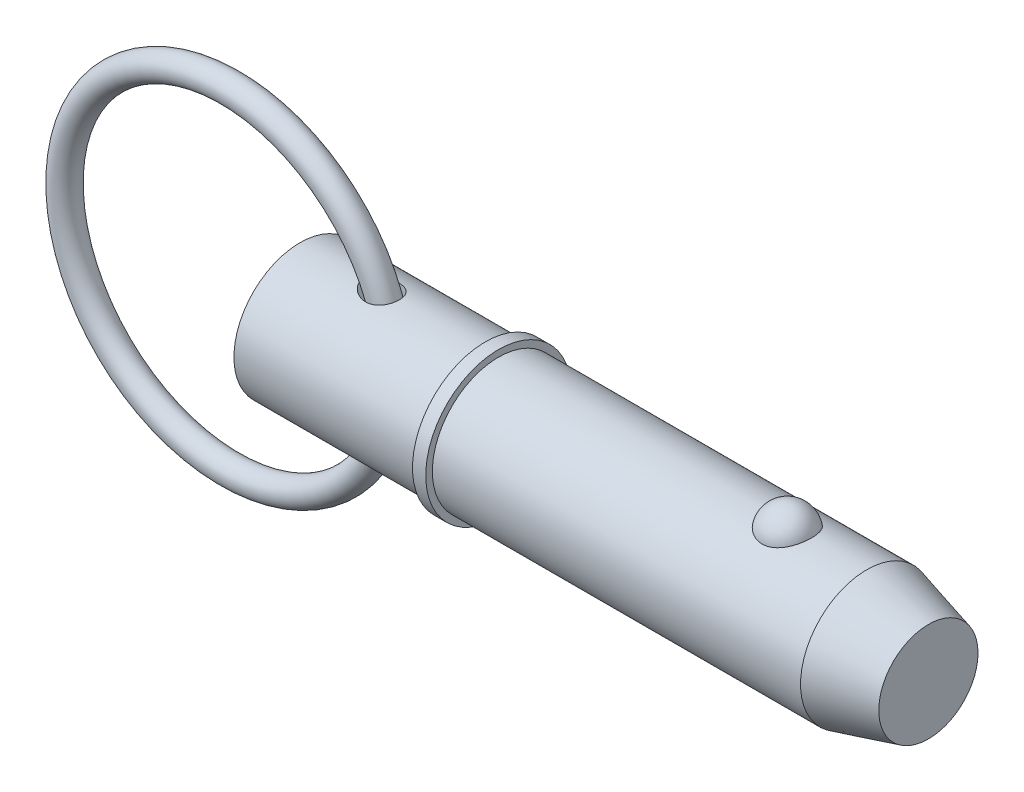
ISO-10303-21;
HEADER;
FILE_DESCRIPTION(('STEP AP214'),'2;1');
FILE_NAME('part.step','',(''),(''),'','','');
FILE_SCHEMA(('AUTOMOTIVE_DESIGN { 1 0 10303 214 1 1 1 1 }'));
ENDSEC;
DATA;
#1=APPLICATION_CONTEXT('core data for automotive mechanical design processes');
#2=APPLICATION_PROTOCOL_DEFINITION('international standard','automotive_design',2000,#1);
#3=PRODUCT_CONTEXT('',#1,'mechanical');
#4=PRODUCT('Part','Part','',(#3));
#5=PRODUCT_RELATED_PRODUCT_CATEGORY('part','',(#4));
#6=PRODUCT_DEFINITION_FORMATION('','',#4);
#7=PRODUCT_DEFINITION_CONTEXT('part definition',#1,'design');
#8=PRODUCT_DEFINITION('design','',#6,#7);
#9=PRODUCT_DEFINITION_SHAPE('','',#8);
#10=(LENGTH_UNIT() NAMED_UNIT(*) SI_UNIT(.MILLI.,.METRE.));
#11=(NAMED_UNIT(*) PLANE_ANGLE_UNIT() SI_UNIT($,.RADIAN.));
#12=(NAMED_UNIT(*) SI_UNIT($,.STERADIAN.) SOLID_ANGLE_UNIT());
#13=UNCERTAINTY_MEASURE_WITH_UNIT(LENGTH_MEASURE(1.E-05),#10,'distance_accuracy_value','');
#14=(GEOMETRIC_REPRESENTATION_CONTEXT(3) GLOBAL_UNCERTAINTY_ASSIGNED_CONTEXT((#13)) GLOBAL_UNIT_ASSIGNED_CONTEXT((#10,
#11,#12)) REPRESENTATION_CONTEXT('',''));
#15=CARTESIAN_POINT('',(0.,0.,0.));
#16=DIRECTION('',(0.,0.,1.));
#17=DIRECTION('',(1.,0.,0.));
#18=AXIS2_PLACEMENT_3D('',#15,#16,#17);
#19=CARTESIAN_POINT('',(-13.4840686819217,0.,0.));
#20=DIRECTION('',(0.,0.,1.));
#21=DIRECTION('',(1.,0.,0.));
#22=AXIS2_PLACEMENT_3D('',#19,#20,#21);
#23=TOROIDAL_SURFACE('',#22,31.75,2.54);
#24=CARTESIAN_POINT('',(20.8059313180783,0.,0.));
#25=VERTEX_POINT('',#24);
#26=VERTEX_LOOP('',#25);
#27=FACE_BOUND('',#26,.T.);
#28=ADVANCED_FACE('P0_F12',(#27),#23,.T.);
#29=CLOSED_SHELL('',(#28));
#30=MANIFOLD_SOLID_BREP('P0_B1',#29);
#31=CARTESIAN_POINT('',(0.,0.,0.));
#32=DIRECTION('',(1.,0.,0.));
#33=DIRECTION('',(0.,0.,-1.));
#34=AXIS2_PLACEMENT_3D('',#31,#32,#33);
#35=CYLINDRICAL_SURFACE('',#34,12.7);
#36=CARTESIAN_POINT('',(13.092900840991,12.5230976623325,-2.11234992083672));
#37=CARTESIAN_POINT('',(13.2535855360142,12.4976398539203,-2.26328363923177));
#38=CARTESIAN_POINT('',(13.4280602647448,12.4718592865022,-2.3995578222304));
#39=CARTESIAN_POINT('',(13.7976341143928,12.4229301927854,-2.64122157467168));
#40=CARTESIAN_POINT('',(13.9927568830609,12.3997847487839,-2.74657519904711));
#41=CARTESIAN_POINT('',(14.397672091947,12.3590534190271,-2.92439761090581));
#42=CARTESIAN_POINT('',(14.6074445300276,12.3414601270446,-2.99691026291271));
#43=CARTESIAN_POINT('',(15.0366557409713,12.3142893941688,-3.10669649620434));
#44=CARTESIAN_POINT('',(15.2560902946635,12.3047084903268,-3.14398530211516));
#45=CARTESIAN_POINT('',(15.5877843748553,12.2976819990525,-3.17128282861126));
#46=CARTESIAN_POINT('',(15.6989364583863,12.2965677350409,-3.17559470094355));
#47=CARTESIAN_POINT('',(15.9211629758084,12.2969101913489,-3.17427486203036));
#48=CARTESIAN_POINT('',(16.0322374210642,12.2983656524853,-3.16864802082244));
#49=CARTESIAN_POINT('',(16.2532861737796,12.3038832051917,-3.14715368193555));
#50=CARTESIAN_POINT('',(16.363260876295,12.3079443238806,-3.13129000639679));
#51=CARTESIAN_POINT('',(16.5810669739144,12.3185954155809,-3.08912320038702));
#52=CARTESIAN_POINT('',(16.6888986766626,12.3251850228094,-3.06282157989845));
#53=CARTESIAN_POINT('',(16.8894247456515,12.3398294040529,-3.00323791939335));
#54=CARTESIAN_POINT('',(16.9824664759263,12.3476389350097,-2.97106098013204));
#55=CARTESIAN_POINT('',(17.1651267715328,12.3648759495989,-2.89848824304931));
#56=CARTESIAN_POINT('',(17.2547457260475,12.3743032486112,-2.85809338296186));
#57=CARTESIAN_POINT('',(17.4297224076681,12.3944822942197,-2.76927391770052));
#58=CARTESIAN_POINT('',(17.5150817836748,12.40523352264,-2.72085245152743));
#59=CARTESIAN_POINT('',(17.6807665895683,12.4277046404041,-2.61629867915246));
#60=CARTESIAN_POINT('',(17.7610923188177,12.4394244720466,-2.56016683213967));
#61=CARTESIAN_POINT('',(17.9797287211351,12.4733252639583,-2.39133767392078));
#62=CARTESIAN_POINT('',(18.1114611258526,12.4961902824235,-2.27005507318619));
#63=CARTESIAN_POINT('',(18.3518677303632,12.5412050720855,-2.00648954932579));
#64=CARTESIAN_POINT('',(18.4605454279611,12.5633549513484,-1.86420981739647));
#65=CARTESIAN_POINT('',(18.6498843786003,12.6039384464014,-1.56614816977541));
#66=CARTESIAN_POINT('',(18.7311185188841,12.622444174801,-1.41073996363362));
#67=CARTESIAN_POINT('',(18.8669149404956,12.6543302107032,-1.08819514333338));
#68=CARTESIAN_POINT('',(18.921477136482,12.6677105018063,-0.921058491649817));
#69=CARTESIAN_POINT('',(19.0028875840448,12.6879542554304,-0.579029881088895));
#70=CARTESIAN_POINT('',(19.0296164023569,12.6947896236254,-0.404107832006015));
#71=CARTESIAN_POINT('',(19.0543673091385,12.7011128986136,-0.0521104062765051));
#72=CARTESIAN_POINT('',(19.0523885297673,12.7006005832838,0.124965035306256));
#73=CARTESIAN_POINT('',(19.019700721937,12.692266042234,0.476969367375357));
#74=CARTESIAN_POINT('',(18.9888798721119,12.6844153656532,0.651887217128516));
#75=CARTESIAN_POINT('',(18.8990221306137,12.6622099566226,0.99389064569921));
#76=CARTESIAN_POINT('',(18.839985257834,12.6478552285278,1.16097622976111));
#77=CARTESIAN_POINT('',(18.6951419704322,12.6142309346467,1.48231767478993));
#78=CARTESIAN_POINT('',(18.6093706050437,12.5949678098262,1.63659000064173));
#79=CARTESIAN_POINT('',(18.4131352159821,12.5536490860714,1.92810749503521));
#80=CARTESIAN_POINT('',(18.3026732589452,12.5315937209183,2.06535408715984));
#81=CARTESIAN_POINT('',(18.060669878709,12.4872833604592,2.31822774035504));
#82=CARTESIAN_POINT('',(17.9292520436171,12.4650302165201,2.43397343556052));
#83=CARTESIAN_POINT('',(17.6485957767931,12.4226514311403,2.64178289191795));
#84=CARTESIAN_POINT('',(17.4993587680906,12.4025256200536,2.73384854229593));
#85=CARTESIAN_POINT('',(17.1869531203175,12.3664726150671,2.8925825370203));
#86=CARTESIAN_POINT('',(17.0237450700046,12.3505578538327,2.95917592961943));
#87=CARTESIAN_POINT('',(16.6884731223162,12.3245177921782,3.06582547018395));
#88=CARTESIAN_POINT('',(16.516407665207,12.3143935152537,3.10587692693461));
#89=CARTESIAN_POINT('',(16.1604213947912,12.3003788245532,3.16093927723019));
#90=CARTESIAN_POINT('',(15.9763106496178,12.2967791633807,3.17478342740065));
#91=CARTESIAN_POINT('',(15.6080973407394,12.2966663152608,3.17521180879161));
#92=CARTESIAN_POINT('',(15.4239948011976,12.3001555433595,3.16178674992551));
#93=CARTESIAN_POINT('',(15.0417156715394,12.3141744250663,3.10676725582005));
#94=CARTESIAN_POINT('',(14.8439465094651,12.3253658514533,3.06251977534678));
#95=CARTESIAN_POINT('',(14.4574652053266,12.3538942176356,2.94531863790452));
#96=CARTESIAN_POINT('',(14.2687614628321,12.3712367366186,2.87233891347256));
#97=CARTESIAN_POINT('',(13.8856104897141,12.4121323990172,2.69045747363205));
#98=CARTESIAN_POINT('',(13.6926012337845,12.4361434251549,2.57861276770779));
#99=CARTESIAN_POINT('',(13.328588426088,12.4862632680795,2.32379935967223));
#100=CARTESIAN_POINT('',(13.1575718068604,12.5123708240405,2.18084927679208));
#101=CARTESIAN_POINT('',(12.8776146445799,12.5579467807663,1.89840233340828));
#102=CARTESIAN_POINT('',(12.7631663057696,12.5776642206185,1.76440341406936));
#103=CARTESIAN_POINT('',(12.5574911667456,12.6143643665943,1.47931295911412));
#104=CARTESIAN_POINT('',(12.4662309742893,12.6313509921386,1.32824646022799));
#105=CARTESIAN_POINT('',(12.3240650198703,12.6583901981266,1.03598403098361));
#106=CARTESIAN_POINT('',(12.2691183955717,12.6691064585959,0.896822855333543));
#107=CARTESIAN_POINT('',(12.1828741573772,12.6860954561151,0.611068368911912));
#108=CARTESIAN_POINT('',(12.1515620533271,12.6923709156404,0.464479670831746));
#109=CARTESIAN_POINT('',(12.1147168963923,12.6997676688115,0.167420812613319));
#110=CARTESIAN_POINT('',(12.1092708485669,12.7008715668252,0.0169392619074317));
#111=CARTESIAN_POINT('',(12.1248234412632,12.6977391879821,-0.282592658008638));
#112=CARTESIAN_POINT('',(12.1458245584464,12.6935024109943,-0.431642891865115));
#113=CARTESIAN_POINT('',(12.210908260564,12.6805581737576,-0.716008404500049));
#114=CARTESIAN_POINT('',(12.2537133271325,12.6720986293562,-0.851633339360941));
#115=CARTESIAN_POINT('',(12.3591295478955,12.6516826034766,-1.11460776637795));
#116=CARTESIAN_POINT('',(12.4217455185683,12.6397252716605,-1.24195523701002));
#117=CARTESIAN_POINT('',(12.5735635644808,12.61152213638,-1.50300095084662));
#118=CARTESIAN_POINT('',(12.6652159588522,12.5949150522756,-1.63522875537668));
#119=CARTESIAN_POINT('',(12.8664347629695,12.5599626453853,-1.88501670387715));
#120=CARTESIAN_POINT('',(12.9760196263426,12.541615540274,-2.0025615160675));
#121=CARTESIAN_POINT('',(13.092900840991,12.5230976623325,-2.11234992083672));
#122=B_SPLINE_CURVE_WITH_KNOTS('',3,(#36,#37,#38,#39,#40,#41,#42,#43,#44,#45,#46,#47,#48,#49,
#50,#51,#52,#53,#54,#55,#56,#57,#58,#59,#60,#61,#62,#63,#64,#65,#66,#67,#68,#69,#70,#71,#72,#73,
#74,#75,#76,#77,#78,#79,#80,#81,#82,#83,#84,#85,#86,#87,#88,#89,#90,#91,#92,#93,#94,#95,#96,#97,
#98,#99,#100,#101,#102,#103,#104,#105,#106,#107,#108,#109,#110,#111,#112,#113,#114,#115,#116,
#117,#118,#119,#120,#121),.UNSPECIFIED.,.T.,.F.,(4,2,2,2,2,2,2,2,2,2,2,2,2,2,2,2,2,2,2,2,2,2,2,
2,2,2,2,2,2,2,2,2,2,2,2,2,2,2,2,2,2,2,4),(0.,0.665132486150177,1.33103515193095,
1.99604575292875,2.66076878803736,2.99410229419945,3.32727250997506,3.66031840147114,
3.99331613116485,4.28918991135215,4.58502994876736,4.88075456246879,5.17646157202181,
5.71510826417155,6.2536731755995,6.78017774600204,7.30668400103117,7.83544030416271,
8.36421259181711,8.89504347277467,9.42587399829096,9.95601150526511,10.4861046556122,
11.0131799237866,11.5402131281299,12.0687854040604,12.5974510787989,13.1491450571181,
13.7010270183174,14.3074556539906,14.914435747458,15.5844380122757,16.2540403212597,
16.7839879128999,17.3131679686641,17.7612578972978,18.2090728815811,18.658393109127,
19.1077554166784,19.5333866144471,19.959121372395,20.4424347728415,20.9262486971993),.UNSPECIFIED.);
#123=CARTESIAN_POINT('',(13.092900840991,12.5230976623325,-2.11234992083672));
#124=VERTEX_POINT('',#123);
#125=EDGE_CURVE('P1_E42',#124,#124,#122,.T.);
#126=ORIENTED_EDGE('',*,*,#125,.T.);
#127=EDGE_LOOP('',(#126));
#128=FACE_BOUND('',#127,.T.);
#129=CARTESIAN_POINT('',(0.,0.,0.));
#130=DIRECTION('',(1.,0.,0.));
#131=DIRECTION('',(0.,0.,-1.));
#132=AXIS2_PLACEMENT_3D('',#129,#130,#131);
#133=CIRCLE('',#132,12.7);
#134=CARTESIAN_POINT('',(0.,0.,-12.7));
#135=VERTEX_POINT('',#134);
#136=EDGE_CURVE('P1_E9',#135,#135,#133,.T.);
#137=ORIENTED_EDGE('',*,*,#136,.T.);
#138=EDGE_LOOP('',(#137));
#139=FACE_BOUND('',#138,.T.);
#140=CARTESIAN_POINT('',(35.56,0.,0.));
#141=DIRECTION('',(1.,0.,0.));
#142=DIRECTION('',(0.,0.,-1.));
#143=AXIS2_PLACEMENT_3D('',#140,#141,#142);
#144=CIRCLE('',#143,12.7);
#145=CARTESIAN_POINT('',(35.56,0.,-12.7));
#146=VERTEX_POINT('',#145);
#147=EDGE_CURVE('P1_E25',#146,#146,#144,.T.);
#148=ORIENTED_EDGE('',*,*,#147,.F.);
#149=EDGE_LOOP('',(#148));
#150=FACE_BOUND('',#149,.T.);
#151=CARTESIAN_POINT('',(13.092900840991,-12.5230976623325,-2.11234992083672));
#152=CARTESIAN_POINT('',(12.9659872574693,-12.5432050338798,-1.99314161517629));
#153=CARTESIAN_POINT('',(12.847667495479,-12.5631124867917,-1.86478966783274));
#154=CARTESIAN_POINT('',(12.6324721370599,-12.6007427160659,-1.59069749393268));
#155=CARTESIAN_POINT('',(12.5355833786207,-12.6184668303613,-1.444968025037));
#156=CARTESIAN_POINT('',(12.409907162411,-12.642034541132,-1.21450950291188));
#157=CARTESIAN_POINT('',(12.3711427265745,-12.6494175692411,-1.13527163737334));
#158=CARTESIAN_POINT('',(12.3010994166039,-12.6628962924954,-0.973464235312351));
#159=CARTESIAN_POINT('',(12.2698164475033,-12.6689926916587,-0.890896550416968));
#160=CARTESIAN_POINT('',(12.2153933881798,-12.6796767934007,-0.723090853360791));
#161=CARTESIAN_POINT('',(12.192246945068,-12.6842656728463,-0.637854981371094));
#162=CARTESIAN_POINT('',(12.154603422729,-12.6917620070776,-0.465421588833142));
#163=CARTESIAN_POINT('',(12.1401047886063,-12.69466976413,-0.378224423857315));
#164=CARTESIAN_POINT('',(12.1214471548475,-12.6984180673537,-0.214417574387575));
#165=CARTESIAN_POINT('',(12.1161713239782,-12.699481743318,-0.137938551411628));
#166=CARTESIAN_POINT('',(12.1124989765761,-12.7002217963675,0.0152189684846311));
#167=CARTESIAN_POINT('',(12.1141046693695,-12.6998977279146,0.0918975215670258));
#168=CARTESIAN_POINT('',(12.1241695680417,-12.6978712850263,0.24474645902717));
#169=CARTESIAN_POINT('',(12.132625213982,-12.6961696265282,0.320917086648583));
#170=CARTESIAN_POINT('',(12.1562110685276,-12.6914452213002,0.472185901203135));
#171=CARTESIAN_POINT('',(12.1713438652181,-12.6884219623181,0.547283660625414));
#172=CARTESIAN_POINT('',(12.223731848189,-12.6780227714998,0.759415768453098));
#173=CARTESIAN_POINT('',(12.268839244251,-12.6691353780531,0.894507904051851));
#174=CARTESIAN_POINT('',(12.3786059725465,-12.6479567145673,1.1560647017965));
#175=CARTESIAN_POINT('',(12.4432700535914,-12.6356646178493,1.28252725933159));
#176=CARTESIAN_POINT('',(12.5971341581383,-12.607236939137,1.5381272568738));
#177=CARTESIAN_POINT('',(12.6882234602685,-12.5908303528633,1.66609325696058));
#178=CARTESIAN_POINT('',(12.887209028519,-12.5564642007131,1.90792082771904));
#179=CARTESIAN_POINT('',(12.995115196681,-12.5385037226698,2.02177401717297));
#180=CARTESIAN_POINT('',(13.2471335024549,-12.4987806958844,2.25547266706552));
#181=CARTESIAN_POINT('',(13.3941979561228,-12.4769622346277,2.3721269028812));
#182=CARTESIAN_POINT('',(13.7036983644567,-12.4349587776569,2.58329351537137));
#183=CARTESIAN_POINT('',(13.8661464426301,-12.4147750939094,2.67778822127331));
#184=CARTESIAN_POINT('',(14.2306024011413,-12.3748157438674,2.85722657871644));
#185=CARTESIAN_POINT('',(14.4347220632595,-12.3556533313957,2.93804226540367));
#186=CARTESIAN_POINT('',(14.8540416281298,-12.3245430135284,3.06594877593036));
#187=CARTESIAN_POINT('',(15.0692453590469,-12.3125976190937,3.11302786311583));
#188=CARTESIAN_POINT('',(15.3981213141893,-12.3014943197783,3.15648626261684));
#189=CARTESIAN_POINT('',(15.5100235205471,-12.298940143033,3.16639841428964));
#190=CARTESIAN_POINT('',(15.7342812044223,-12.2963942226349,3.17627668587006));
#191=CARTESIAN_POINT('',(15.8466364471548,-12.2964012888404,3.1762474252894));
#192=CARTESIAN_POINT('',(16.0707903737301,-12.2990694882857,3.16589868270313));
#193=CARTESIAN_POINT('',(16.1825892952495,-12.3017293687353,3.1555840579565));
#194=CARTESIAN_POINT('',(16.4046123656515,-12.3096862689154,3.12440163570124));
#195=CARTESIAN_POINT('',(16.514836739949,-12.314982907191,3.10353536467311));
#196=CARTESIAN_POINT('',(16.7211934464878,-12.3273933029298,3.05384263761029));
#197=CARTESIAN_POINT('',(16.8175961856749,-12.3342598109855,3.0260738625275));
#198=CARTESIAN_POINT('',(17.0073515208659,-12.3498131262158,2.96195947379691));
#199=CARTESIAN_POINT('',(17.100704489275,-12.3584997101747,2.92561491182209));
#200=CARTESIAN_POINT('',(17.2834584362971,-12.3774243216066,2.84448580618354));
#201=CARTESIAN_POINT('',(17.3728610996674,-12.3876616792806,2.79970490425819));
#202=CARTESIAN_POINT('',(17.5469061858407,-12.409352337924,2.701939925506));
#203=CARTESIAN_POINT('',(17.6315489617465,-12.4208055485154,2.64895645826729));
#204=CARTESIAN_POINT('',(17.7872886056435,-12.4433734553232,2.54070972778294));
#205=CARTESIAN_POINT('',(17.8589017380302,-12.4544123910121,2.48617167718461));
#206=CARTESIAN_POINT('',(17.9970802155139,-12.4768404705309,2.37105291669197));
#207=CARTESIAN_POINT('',(18.063643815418,-12.4882297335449,2.31047013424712));
#208=CARTESIAN_POINT('',(18.1911677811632,-12.5110137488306,2.18372894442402));
#209=CARTESIAN_POINT('',(18.2521311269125,-12.5224084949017,2.11757353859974));
#210=CARTESIAN_POINT('',(18.3680676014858,-12.5448751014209,1.98014449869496));
#211=CARTESIAN_POINT('',(18.4230385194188,-12.5559468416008,1.90886899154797));
#212=CARTESIAN_POINT('',(18.5752306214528,-12.5875288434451,1.69257698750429));
#213=CARTESIAN_POINT('',(18.6637018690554,-12.6071482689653,1.54111740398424));
#214=CARTESIAN_POINT('',(18.8143485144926,-12.6417556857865,1.225260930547));
#215=CARTESIAN_POINT('',(18.876524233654,-12.6567437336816,1.06086419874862));
#216=CARTESIAN_POINT('',(18.9733884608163,-12.6805238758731,0.723195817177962));
#217=CARTESIAN_POINT('',(19.0079967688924,-12.6892978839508,0.549899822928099));
#218=CARTESIAN_POINT('',(19.0486500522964,-12.6996362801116,0.199781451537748));
#219=CARTESIAN_POINT('',(19.054694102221,-12.7012004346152,0.0229589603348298));
#220=CARTESIAN_POINT('',(19.0380549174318,-12.6969431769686,-0.330044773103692));
#221=CARTESIAN_POINT('',(19.0152419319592,-12.6910884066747,-0.506219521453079));
#222=CARTESIAN_POINT('',(18.9411599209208,-12.672565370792,-0.852112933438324));
#223=CARTESIAN_POINT('',(18.8898907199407,-12.659897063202,-1.0218315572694));
#224=CARTESIAN_POINT('',(18.7600888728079,-12.6291327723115,-1.34987035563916));
#225=CARTESIAN_POINT('',(18.6815715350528,-12.6110398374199,-1.50819687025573));
#226=CARTESIAN_POINT('',(18.4991526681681,-12.5714188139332,-1.808997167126));
#227=CARTESIAN_POINT('',(18.3952529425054,-12.5498909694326,-1.95147207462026));
#228=CARTESIAN_POINT('',(18.1653806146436,-12.5059234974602,-2.21580059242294));
#229=CARTESIAN_POINT('',(18.0395297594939,-12.4834893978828,-2.33776101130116));
#230=CARTESIAN_POINT('',(17.7688701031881,-12.4400863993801,-2.55870399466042));
#231=CARTESIAN_POINT('',(17.6240631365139,-12.4191173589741,-2.65768878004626));
#232=CARTESIAN_POINT('',(17.3196803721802,-12.380896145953,-2.8304192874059));
#233=CARTESIAN_POINT('',(17.1601036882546,-12.3636441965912,-2.90416349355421));
#234=CARTESIAN_POINT('',(16.8308162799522,-12.3345597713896,-3.02531546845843));
#235=CARTESIAN_POINT('',(16.6611041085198,-12.322728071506,-3.07271946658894));
#236=CARTESIAN_POINT('',(16.3099674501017,-12.3051318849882,-3.14246490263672));
#237=CARTESIAN_POINT('',(16.1283412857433,-12.2996014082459,-3.16384159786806));
#238=CARTESIAN_POINT('',(15.7639014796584,-12.2955807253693,-3.17942379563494));
#239=CARTESIAN_POINT('',(15.5810875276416,-12.2970924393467,-3.17362188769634));
#240=CARTESIAN_POINT('',(15.20154276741,-12.307074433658,-3.13470416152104));
#241=CARTESIAN_POINT('',(15.0050835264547,-12.316173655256,-3.09911848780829));
#242=CARTESIAN_POINT('',(14.6197996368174,-12.3407987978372,-2.99954607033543));
#243=CARTESIAN_POINT('',(14.4309834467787,-12.3563316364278,-2.93552875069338));
#244=CARTESIAN_POINT('',(14.0353751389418,-12.3949378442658,-2.76840280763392));
#245=CARTESIAN_POINT('',(13.8306109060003,-12.4188242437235,-2.66064798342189));
#246=CARTESIAN_POINT('',(13.4432099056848,-12.4696241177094,-2.4113475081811));
#247=CARTESIAN_POINT('',(13.2605568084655,-12.4965353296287,-2.26982702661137));
#248=CARTESIAN_POINT('',(13.092900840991,-12.5230976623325,-2.11234992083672));
#249=B_SPLINE_CURVE_WITH_KNOTS('',3,(#151,#152,#153,#154,#155,#156,#157,#158,#159,#160,#161,
#162,#163,#164,#165,#166,#167,#168,#169,#170,#171,#172,#173,#174,#175,#176,#177,#178,#179,#180,
#181,#182,#183,#184,#185,#186,#187,#188,#189,#190,#191,#192,#193,#194,#195,#196,#197,#198,#199,
#200,#201,#202,#203,#204,#205,#206,#207,#208,#209,#210,#211,#212,#213,#214,#215,#216,#217,#218,
#219,#220,#221,#222,#223,#224,#225,#226,#227,#228,#229,#230,#231,#232,#233,#234,#235,#236,#237,
#238,#239,#240,#241,#242,#243,#244,#245,#246,#247,#248),.UNSPECIFIED.,.T.,.F.,(4,2,2,2,2,2,2,2,
2,2,2,2,2,2,2,2,2,2,2,2,2,2,2,2,2,2,2,2,2,2,2,2,2,2,2,2,2,2,2,2,2,2,2,2,2,2,2,2,4),(0.,
0.525289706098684,1.05025590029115,1.31549608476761,1.58059075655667,1.84547798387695,
2.11031756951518,2.34000998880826,2.56977615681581,2.79942299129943,3.0291589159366,
3.45531787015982,3.8815803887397,4.35362362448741,4.82594586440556,5.39074449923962,
5.95599200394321,6.61421946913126,7.27267581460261,7.60939383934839,7.9459554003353,
8.2823580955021,8.61871213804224,8.91997243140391,9.22119579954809,9.52228943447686,
9.82336070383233,10.0950952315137,10.3669232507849,10.6386057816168,10.9103882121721,
11.4371688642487,11.9639430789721,12.4922442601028,13.0205625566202,13.5512648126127,
14.0819703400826,14.6123781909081,15.1427483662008,15.6702654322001,16.1977314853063,
16.7252292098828,17.2528024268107,17.7993878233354,18.3461222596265,18.9432829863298,
19.541087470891,20.2355241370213,20.9294447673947),.UNSPECIFIED.);
#250=CARTESIAN_POINT('',(13.092900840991,-12.5230976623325,-2.11234992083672));
#251=VERTEX_POINT('',#250);
#252=EDGE_CURVE('P1_E17',#251,#251,#249,.T.);
#253=ORIENTED_EDGE('',*,*,#252,.T.);
#254=EDGE_LOOP('',(#253));
#255=FACE_BOUND('',#254,.T.);
#256=ADVANCED_FACE('P1_F13',(#128,#139,#150,#255),#35,.T.);
#257=CARTESIAN_POINT('',(0.,0.,0.));
#258=DIRECTION('',(1.,0.,0.));
#259=DIRECTION('',(0.,0.,-1.));
#260=AXIS2_PLACEMENT_3D('',#257,#258,#259);
#261=CYLINDRICAL_SURFACE('',#260,12.7);
#262=CARTESIAN_POINT('',(108.800738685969,0.,0.));
#263=DIRECTION('',(1.,0.,0.));
#264=DIRECTION('',(0.,0.,-1.));
#265=AXIS2_PLACEMENT_3D('',#262,#263,#264);
#266=CIRCLE('',#265,12.7);
#267=CARTESIAN_POINT('',(108.800738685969,0.,-12.7));
#268=VERTEX_POINT('',#267);
#269=EDGE_CURVE('P1_E99',#268,#268,#266,.T.);
#270=ORIENTED_EDGE('',*,*,#269,.F.);
#271=EDGE_LOOP('',(#270));
#272=FACE_BOUND('',#271,.T.);
#273=CARTESIAN_POINT('',(38.1,0.,0.));
#274=DIRECTION('',(1.,0.,0.));
#275=DIRECTION('',(0.,0.,-1.));
#276=AXIS2_PLACEMENT_3D('',#273,#274,#275);
#277=CIRCLE('',#276,12.7);
#278=CARTESIAN_POINT('',(38.1,0.,-12.7));
#279=VERTEX_POINT('',#278);
#280=EDGE_CURVE('P1_E96',#279,#279,#277,.T.);
#281=ORIENTED_EDGE('',*,*,#280,.T.);
#282=EDGE_LOOP('',(#281));
#283=FACE_BOUND('',#282,.T.);
#284=CARTESIAN_POINT('',(93.5600429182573,11.7500437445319,4.81938502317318));
#285=CARTESIAN_POINT('',(93.4350881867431,11.7500430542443,4.81938571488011));
#286=CARTESIAN_POINT('',(93.310144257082,11.7520975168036,4.81438658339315));
#287=CARTESIAN_POINT('',(93.0611425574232,11.760253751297,4.79442904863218));
#288=CARTESIAN_POINT('',(92.9370850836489,11.7663568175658,4.77946746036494));
#289=CARTESIAN_POINT('',(92.6909016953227,11.7824262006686,4.7397141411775));
#290=CARTESIAN_POINT('',(92.5687744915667,11.7923898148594,4.71492928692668));
#291=CARTESIAN_POINT('',(92.3271874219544,11.8158938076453,4.65571340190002));
#292=CARTESIAN_POINT('',(92.2077285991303,11.8294355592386,4.6212786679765));
#293=CARTESIAN_POINT('',(91.9725578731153,11.8596812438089,4.54309502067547));
#294=CARTESIAN_POINT('',(91.8568393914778,11.8763792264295,4.49936361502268));
#295=CARTESIAN_POINT('',(91.6296530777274,11.9124878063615,4.40287235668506));
#296=CARTESIAN_POINT('',(91.5181868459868,11.9318994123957,4.35010914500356));
#297=CARTESIAN_POINT('',(91.1912782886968,11.9934256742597,4.17881316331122));
#298=CARTESIAN_POINT('',(90.9831270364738,12.038858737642,4.04720756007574));
#299=CARTESIAN_POINT('',(90.5858509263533,12.1352173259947,3.748564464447));
#300=CARTESIAN_POINT('',(90.3974438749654,12.1862630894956,3.58061821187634));
#301=CARTESIAN_POINT('',(90.0505213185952,12.2875163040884,3.21600758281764));
#302=CARTESIAN_POINT('',(89.8920113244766,12.3377235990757,3.0193379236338));
#303=CARTESIAN_POINT('',(89.6016887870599,12.434492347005,2.592916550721));
#304=CARTESIAN_POINT('',(89.4713762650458,12.4807925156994,2.36208286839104));
#305=CARTESIAN_POINT('',(89.2494079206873,12.5623454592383,1.88070399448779));
#306=CARTESIAN_POINT('',(89.1577554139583,12.5975972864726,1.63015711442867));
#307=CARTESIAN_POINT('',(89.0140466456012,12.6538414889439,1.1129886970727));
#308=CARTESIAN_POINT('',(88.9624990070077,12.6746503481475,0.846205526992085));
#309=CARTESIAN_POINT('',(88.9019771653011,12.699153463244,0.307085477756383));
#310=CARTESIAN_POINT('',(88.8930018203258,12.7028481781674,0.0347487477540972));
#311=CARTESIAN_POINT('',(88.9177310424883,12.6927785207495,-0.506073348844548));
#312=CARTESIAN_POINT('',(88.9511899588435,12.6791146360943,-0.77457186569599));
#313=CARTESIAN_POINT('',(89.0596877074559,12.635882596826,-1.30170246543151));
#314=CARTESIAN_POINT('',(89.1347272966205,12.606314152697,-1.5603343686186));
#315=CARTESIAN_POINT('',(89.3250000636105,12.5342328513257,-2.06083899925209));
#316=CARTESIAN_POINT('',(89.4402872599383,12.4917026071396,-2.3026886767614));
#317=CARTESIAN_POINT('',(89.7087044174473,12.3981123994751,-2.76259600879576));
#318=CARTESIAN_POINT('',(89.8618374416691,12.3470517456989,-2.98065173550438));
#319=CARTESIAN_POINT('',(90.2035077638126,12.2416045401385,-3.38786328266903));
#320=CARTESIAN_POINT('',(90.3922017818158,12.1872040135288,-3.57688418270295));
#321=CARTESIAN_POINT('',(90.8002392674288,12.0814086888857,-3.91941073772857));
#322=CARTESIAN_POINT('',(91.0195800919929,12.0300136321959,-4.07291945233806));
#323=CARTESIAN_POINT('',(91.4783753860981,11.9373542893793,-4.33691289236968));
#324=CARTESIAN_POINT('',(91.7173044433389,11.8958982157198,-4.44824125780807));
#325=CARTESIAN_POINT('',(92.2124376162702,11.8268116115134,-4.62881985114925));
#326=CARTESIAN_POINT('',(92.4686351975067,11.7991758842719,-4.69808589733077));
#327=CARTESIAN_POINT('',(92.9771640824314,11.7622209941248,-4.78983181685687));
#328=CARTESIAN_POINT('',(93.2290414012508,11.7520502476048,-4.81449025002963));
#329=CARTESIAN_POINT('',(93.7335734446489,11.7485796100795,-4.82295735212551));
#330=CARTESIAN_POINT('',(93.9862280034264,11.7552763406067,-4.80677420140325));
#331=CARTESIAN_POINT('',(94.4768341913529,11.7842584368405,-4.73525430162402));
#332=CARTESIAN_POINT('',(94.7149984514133,11.8060486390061,-4.68116061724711));
#333=CARTESIAN_POINT('',(95.1784894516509,11.8622750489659,-4.53678133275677));
#334=CARTESIAN_POINT('',(95.4038151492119,11.8967122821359,-4.44649279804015));
#335=CARTESIAN_POINT('',(95.8408018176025,11.9754603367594,-4.2298761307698));
#336=CARTESIAN_POINT('',(96.0520579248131,12.0199699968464,-4.10280539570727));
#337=CARTESIAN_POINT('',(96.4506012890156,12.1138028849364,-3.81685409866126));
#338=CARTESIAN_POINT('',(96.6378830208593,12.163127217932,-3.65796622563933));
#339=CARTESIAN_POINT('',(96.9933509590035,12.2642343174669,-3.30364864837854));
#340=CARTESIAN_POINT('',(97.1601119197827,12.3160165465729,-3.10678783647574));
#341=CARTESIAN_POINT('',(97.4595799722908,12.4142566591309,-2.68748409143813));
#342=CARTESIAN_POINT('',(97.5922809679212,12.4607135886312,-2.46503658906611));
#343=CARTESIAN_POINT('',(97.8246912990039,12.5450236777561,-1.99289519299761));
#344=CARTESIAN_POINT('',(97.923215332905,12.5825557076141,-1.74255918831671));
#345=CARTESIAN_POINT('',(98.0792277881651,12.6431720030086,-1.22773734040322));
#346=CARTESIAN_POINT('',(98.1367157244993,12.6662560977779,-0.963251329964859));
#347=CARTESIAN_POINT('',(98.2095441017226,12.6956486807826,-0.427355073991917));
#348=CARTESIAN_POINT('',(98.2248378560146,12.7019385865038,-0.1559374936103));
#349=CARTESIAN_POINT('',(98.2127794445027,12.6970201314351,0.385928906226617));
#350=CARTESIAN_POINT('',(98.1854280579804,12.6858120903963,0.656377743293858));
#351=CARTESIAN_POINT('',(98.1130609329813,12.6568455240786,1.05454017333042));
#352=CARTESIAN_POINT('',(98.0837963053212,12.6451962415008,1.18577850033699));
#353=CARTESIAN_POINT('',(98.0150228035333,12.6181819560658,1.4451380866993));
#354=CARTESIAN_POINT('',(97.9755176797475,12.6028183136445,1.57326046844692));
#355=CARTESIAN_POINT('',(97.8864397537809,12.5687547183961,1.82554978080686));
#356=CARTESIAN_POINT('',(97.8368627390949,12.5500533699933,1.9497150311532));
#357=CARTESIAN_POINT('',(97.7279211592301,12.5098093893,2.1931437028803));
#358=CARTESIAN_POINT('',(97.6685601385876,12.4882677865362,2.31240887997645));
#359=CARTESIAN_POINT('',(97.5399712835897,12.4427679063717,2.54593031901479));
#360=CARTESIAN_POINT('',(97.4706888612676,12.4187964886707,2.66015396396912));
#361=CARTESIAN_POINT('',(97.322903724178,12.3691892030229,2.88202659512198));
#362=CARTESIAN_POINT('',(97.2444044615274,12.3435539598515,2.98967802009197));
#363=CARTESIAN_POINT('',(97.0785502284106,12.2912955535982,3.19774385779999));
#364=CARTESIAN_POINT('',(96.9911918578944,12.2646720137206,3.29815546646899));
#365=CARTESIAN_POINT('',(96.8081617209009,12.2111945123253,3.49095035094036));
#366=CARTESIAN_POINT('',(96.7124932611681,12.1843406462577,3.58333679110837));
#367=CARTESIAN_POINT('',(96.5136272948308,12.1312249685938,3.75922876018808));
#368=CARTESIAN_POINT('',(96.4104503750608,12.104961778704,3.84275713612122));
#369=CARTESIAN_POINT('',(96.1970133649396,12.0537284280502,4.00056406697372));
#370=CARTESIAN_POINT('',(96.0867562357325,12.028757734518,4.07484645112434));
#371=CARTESIAN_POINT('',(95.8597550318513,11.9808306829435,4.21367959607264));
#372=CARTESIAN_POINT('',(95.7430068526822,11.9578756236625,4.27822410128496));
#373=CARTESIAN_POINT('',(95.5039425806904,11.9147184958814,4.39698483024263));
#374=CARTESIAN_POINT('',(95.3816287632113,11.894515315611,4.45120522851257));
#375=CARTESIAN_POINT('',(95.122952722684,11.8561129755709,4.55255353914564));
#376=CARTESIAN_POINT('',(94.9862237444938,11.8381764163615,4.59884858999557));
#377=CARTESIAN_POINT('',(94.7086087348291,11.8069093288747,4.67853897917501));
#378=CARTESIAN_POINT('',(94.5677245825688,11.7935767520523,4.71194005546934));
#379=CARTESIAN_POINT('',(94.2830944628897,11.7720277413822,4.76552188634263));
#380=CARTESIAN_POINT('',(94.1393488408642,11.7638106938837,4.78570422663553));
#381=CARTESIAN_POINT('',(93.8504114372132,11.7528195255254,4.81263433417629));
#382=CARTESIAN_POINT('',(93.7052198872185,11.7500445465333,4.81938421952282));
#383=CARTESIAN_POINT('',(93.5600429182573,11.7500437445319,4.81938502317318));
#384=B_SPLINE_CURVE_WITH_KNOTS('',3,(#284,#285,#286,#287,#288,#289,#290,#291,#292,#293,#294,
#295,#296,#297,#298,#299,#300,#301,#302,#303,#304,#305,#306,#307,#308,#309,#310,#311,#312,#313,
#314,#315,#316,#317,#318,#319,#320,#321,#322,#323,#324,#325,#326,#327,#328,#329,#330,#331,#332,
#333,#334,#335,#336,#337,#338,#339,#340,#341,#342,#343,#344,#345,#346,#347,#348,#349,#350,#351,
#352,#353,#354,#355,#356,#357,#358,#359,#360,#361,#362,#363,#364,#365,#366,#367,#368,#369,#370,
#371,#372,#373,#374,#375,#376,#377,#378,#379,#380,#381,#382,#383),.UNSPECIFIED.,.T.,.F.,(4,2,2,
2,2,2,2,2,2,2,2,2,2,2,2,2,2,2,2,2,2,2,2,2,2,2,2,2,2,2,2,2,2,2,2,2,2,2,2,2,2,2,2,2,2,2,2,2,2,4),
(0.,0.374729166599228,0.749578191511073,1.12416526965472,1.49889629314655,1.87292776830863,
2.24709865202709,2.99481328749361,3.76399449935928,4.53331735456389,5.3368391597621,
6.14042986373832,6.95405296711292,7.76765424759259,8.57656703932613,9.38549455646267,
10.1955119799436,11.0055949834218,11.8193353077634,12.6330054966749,13.4294141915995,
14.2255231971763,14.9815786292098,15.7374826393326,16.4696948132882,17.2019663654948,
17.9501979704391,18.6986017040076,19.484470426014,20.2704797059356,21.0815215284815,
21.8925729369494,22.7045213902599,23.5164550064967,23.9209608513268,24.3253187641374,
24.7298461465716,25.1342272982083,25.54092555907,25.9474719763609,26.3541750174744,
26.7607169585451,27.1661834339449,27.5714814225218,27.9770386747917,28.3824315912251,
28.8181206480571,29.2536155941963,29.6890582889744,30.1244323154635),.UNSPECIFIED.);
#385=CARTESIAN_POINT('',(93.5600429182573,11.7500437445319,4.81938502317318));
#386=VERTEX_POINT('',#385);
#387=EDGE_CURVE('P1_E34',#386,#386,#384,.T.);
#388=ORIENTED_EDGE('',*,*,#387,.T.);
#389=EDGE_LOOP('',(#388));
#390=FACE_BOUND('',#389,.T.);
#391=ADVANCED_FACE('P1_F46',(#272,#283,#390),#261,.T.);
#392=CARTESIAN_POINT('',(0.,0.,0.));
#393=DIRECTION('',(-1.,0.,0.));
#394=DIRECTION('',(0.,0.,1.));
#395=AXIS2_PLACEMENT_3D('',#392,#393,#394);
#396=PLANE('',#395);
#397=ORIENTED_EDGE('',*,*,#136,.F.);
#398=EDGE_LOOP('',(#397));
#399=FACE_BOUND('',#398,.T.);
#400=ADVANCED_FACE('P1_F15',(#399),#396,.T.);
#401=CARTESIAN_POINT('',(35.56,12.7,0.));
#402=DIRECTION('',(-1.,0.,0.));
#403=DIRECTION('',(0.,0.,1.));
#404=AXIS2_PLACEMENT_3D('',#401,#402,#403);
#405=PLANE('',#404);
#406=ORIENTED_EDGE('',*,*,#147,.T.);
#407=EDGE_LOOP('',(#406));
#408=FACE_BOUND('',#407,.T.);
#409=CARTESIAN_POINT('',(35.56,0.,0.));
#410=DIRECTION('',(1.,0.,0.));
#411=DIRECTION('',(0.,0.,-1.));
#412=AXIS2_PLACEMENT_3D('',#409,#410,#411);
#413=CIRCLE('',#412,13.97);
#414=CARTESIAN_POINT('',(35.56,0.,-13.97));
#415=VERTEX_POINT('',#414);
#416=EDGE_CURVE('P1_E30',#415,#415,#413,.T.);
#417=ORIENTED_EDGE('',*,*,#416,.F.);
#418=EDGE_LOOP('',(#417));
#419=FACE_BOUND('',#418,.T.);
#420=ADVANCED_FACE('P1_F81',(#408,#419),#405,.T.);
#421=CARTESIAN_POINT('',(0.,0.,0.));
#422=DIRECTION('',(1.,0.,0.));
#423=DIRECTION('',(0.,0.,-1.));
#424=AXIS2_PLACEMENT_3D('',#421,#422,#423);
#425=CYLINDRICAL_SURFACE('',#424,13.97);
#426=ORIENTED_EDGE('',*,*,#416,.T.);
#427=EDGE_LOOP('',(#426));
#428=FACE_BOUND('',#427,.T.);
#429=CARTESIAN_POINT('',(38.1,0.,0.));
#430=DIRECTION('',(1.,0.,0.));
#431=DIRECTION('',(0.,0.,-1.));
#432=AXIS2_PLACEMENT_3D('',#429,#430,#431);
#433=CIRCLE('',#432,13.97);
#434=CARTESIAN_POINT('',(38.1,0.,-13.97));
#435=VERTEX_POINT('',#434);
#436=EDGE_CURVE('P1_E95',#435,#435,#433,.T.);
#437=ORIENTED_EDGE('',*,*,#436,.F.);
#438=EDGE_LOOP('',(#437));
#439=FACE_BOUND('',#438,.T.);
#440=ADVANCED_FACE('P1_F68',(#428,#439),#425,.T.);
#441=CARTESIAN_POINT('',(38.1,13.97,0.));
#442=DIRECTION('',(1.,0.,0.));
#443=DIRECTION('',(0.,0.,-1.));
#444=AXIS2_PLACEMENT_3D('',#441,#442,#443);
#445=PLANE('',#444);
#446=ORIENTED_EDGE('',*,*,#436,.T.);
#447=EDGE_LOOP('',(#446));
#448=FACE_BOUND('',#447,.T.);
#449=ORIENTED_EDGE('',*,*,#280,.F.);
#450=EDGE_LOOP('',(#449));
#451=FACE_BOUND('',#450,.T.);
#452=ADVANCED_FACE('P1_F62',(#448,#451),#445,.T.);
#453=CARTESIAN_POINT('',(120.65,0.,0.));
#454=DIRECTION('',(-1.,0.,0.));
#455=DIRECTION('',(0.,0.,1.));
#456=AXIS2_PLACEMENT_3D('',#453,#454,#455);
#457=CONICAL_SURFACE('',#456,9.52500000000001,0.26179938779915);
#458=ORIENTED_EDGE('',*,*,#269,.T.);
#459=EDGE_LOOP('',(#458));
#460=FACE_BOUND('',#459,.T.);
#461=CARTESIAN_POINT('',(120.65,0.,0.));
#462=DIRECTION('',(1.,0.,0.));
#463=DIRECTION('',(0.,0.,-1.));
#464=AXIS2_PLACEMENT_3D('',#461,#462,#463);
#465=CIRCLE('',#464,9.52500000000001);
#466=CARTESIAN_POINT('',(120.65,0.,-9.52500000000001));
#467=VERTEX_POINT('',#466);
#468=EDGE_CURVE('P1_E41',#467,#467,#465,.T.);
#469=ORIENTED_EDGE('',*,*,#468,.F.);
#470=EDGE_LOOP('',(#469));
#471=FACE_BOUND('',#470,.T.);
#472=ADVANCED_FACE('P1_F59',(#460,#471),#457,.T.);
#473=CARTESIAN_POINT('',(120.65,9.52500000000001,0.));
#474=DIRECTION('',(1.,0.,0.));
#475=DIRECTION('',(0.,0.,-1.));
#476=AXIS2_PLACEMENT_3D('',#473,#474,#475);
#477=PLANE('',#476);
#478=ORIENTED_EDGE('',*,*,#468,.T.);
#479=EDGE_LOOP('',(#478));
#480=FACE_BOUND('',#479,.T.);
#481=ADVANCED_FACE('P1_F55',(#480),#477,.T.);
#482=CARTESIAN_POINT('',(93.5600429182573,11.43,0.));
#483=DIRECTION('',(-1.,0.,0.));
#484=DIRECTION('',(0.,1.,0.));
#485=AXIS2_PLACEMENT_3D('',#482,#483,#484);
#486=SPHERICAL_SURFACE('',#485,4.83);
#487=ORIENTED_EDGE('',*,*,#387,.F.);
#488=EDGE_LOOP('',(#487));
#489=FACE_BOUND('',#488,.T.);
#490=ADVANCED_FACE('P1_F50',(#489),#486,.T.);
#491=CARTESIAN_POINT('',(-13.4840686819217,0.,0.));
#492=DIRECTION('',(0.,0.,1.));
#493=DIRECTION('',(1.,0.,0.));
#494=AXIS2_PLACEMENT_3D('',#491,#492,#493);
#495=TOROIDAL_SURFACE('',#494,31.75,3.175);
#496=ORIENTED_EDGE('',*,*,#252,.F.);
#497=EDGE_LOOP('',(#496));
#498=FACE_BOUND('',#497,.T.);
#499=ORIENTED_EDGE('',*,*,#125,.F.);
#500=EDGE_LOOP('',(#499));
#501=FACE_BOUND('',#500,.T.);
#502=ADVANCED_FACE('P1_F54',(#498,#501),#495,.F.);
#503=CLOSED_SHELL('',(#256,#391,#400,#420,#440,#452,#472,#481,#490,#502));
#504=MANIFOLD_SOLID_BREP('P1_B1',#503);
#505=ADVANCED_BREP_SHAPE_REPRESENTATION('',(#18,#30,#504),#14);
#506=SHAPE_DEFINITION_REPRESENTATION(#9,#505);
ENDSEC;
END-ISO-10303-21;
